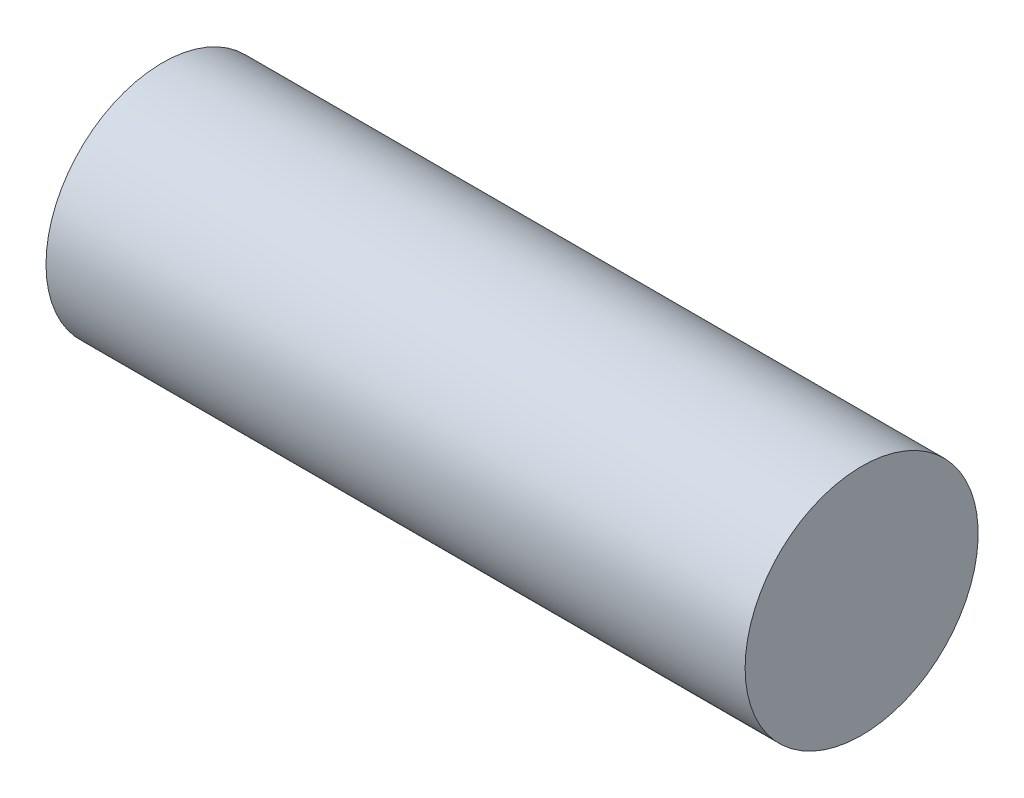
from build123d import *

# Parameters (mm, degrees)
SKETCH1_R           = 7.5
BOSS_EXTRUDE1_DEPTH = 45


with BuildPart() as part:
    # Sketch1 → Boss-Extrude1 (new body)
    with BuildSketch(Plane(origin=(0, 0, 0), x_dir=(0, 0, -1), z_dir=(1, 0, 0))):
        with Locations(Location((0, 0, 0), (0, 0, 180))):
            Circle(SKETCH1_R)
    extrude(amount=BOSS_EXTRUDE1_DEPTH)


solid = part.part
